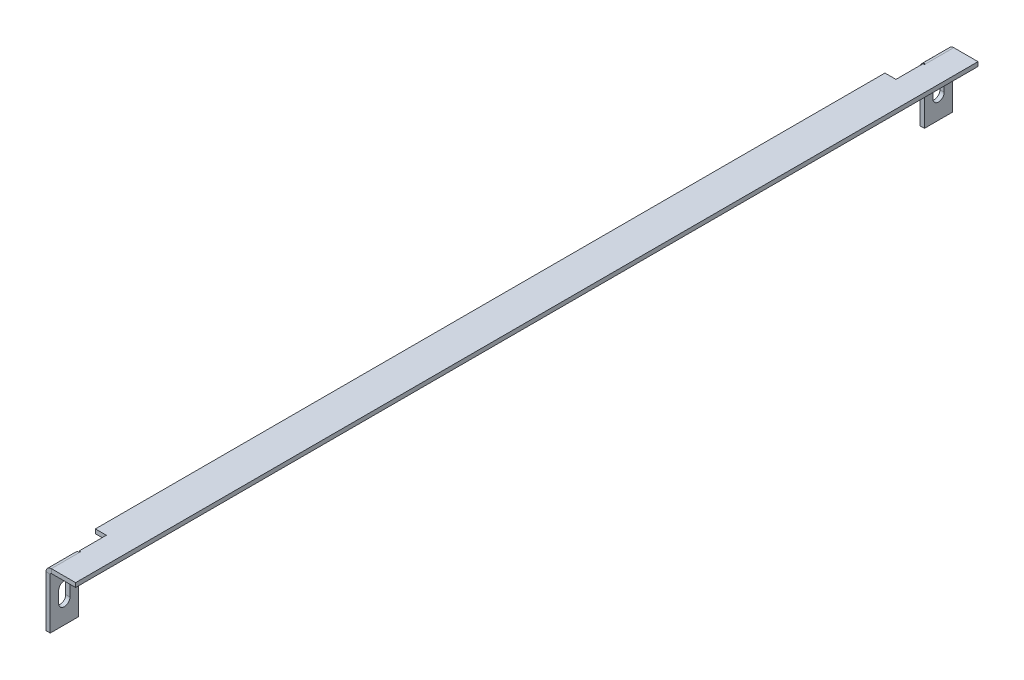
ISO-10303-21;
HEADER;
FILE_DESCRIPTION(('STEP AP214'),'2;1');
FILE_NAME('part.step','',(''),(''),'','','');
FILE_SCHEMA(('AUTOMOTIVE_DESIGN { 1 0 10303 214 1 1 1 1 }'));
ENDSEC;
DATA;
#1=APPLICATION_CONTEXT('core data for automotive mechanical design processes');
#2=APPLICATION_PROTOCOL_DEFINITION('international standard','automotive_design',2000,#1);
#3=PRODUCT_CONTEXT('',#1,'mechanical');
#4=PRODUCT('Part','Part','',(#3));
#5=PRODUCT_RELATED_PRODUCT_CATEGORY('part','',(#4));
#6=PRODUCT_DEFINITION_FORMATION('','',#4);
#7=PRODUCT_DEFINITION_CONTEXT('part definition',#1,'design');
#8=PRODUCT_DEFINITION('design','',#6,#7);
#9=PRODUCT_DEFINITION_SHAPE('','',#8);
#10=(LENGTH_UNIT() NAMED_UNIT(*) SI_UNIT(.MILLI.,.METRE.));
#11=(NAMED_UNIT(*) PLANE_ANGLE_UNIT() SI_UNIT($,.RADIAN.));
#12=(NAMED_UNIT(*) SI_UNIT($,.STERADIAN.) SOLID_ANGLE_UNIT());
#13=UNCERTAINTY_MEASURE_WITH_UNIT(LENGTH_MEASURE(1.E-05),#10,'distance_accuracy_value','');
#14=(GEOMETRIC_REPRESENTATION_CONTEXT(3) GLOBAL_UNCERTAINTY_ASSIGNED_CONTEXT((#13)) GLOBAL_UNIT_ASSIGNED_CONTEXT((#10,
#11,#12)) REPRESENTATION_CONTEXT('',''));
#15=CARTESIAN_POINT('',(0.,0.,0.));
#16=DIRECTION('',(0.,0.,1.));
#17=DIRECTION('',(1.,0.,0.));
#18=AXIS2_PLACEMENT_3D('',#15,#16,#17);
#19=CARTESIAN_POINT('',(29.999999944,-16.8000000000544,305.999999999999));
#20=DIRECTION('',(0.,0.,-1.));
#21=DIRECTION('',(-1.,0.,0.));
#22=AXIS2_PLACEMENT_3D('',#19,#20,#21);
#23=PLANE('',#22);
#24=DIRECTION('',(0.,1.,0.));
#25=VECTOR('',#24,1.);
#26=CARTESIAN_POINT('',(8.99999999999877,-80.1123422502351,305.999999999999));
#27=LINE('',#26,#25);
#28=CARTESIAN_POINT('',(8.99999999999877,-16.8000000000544,305.999999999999));
#29=VERTEX_POINT('',#28);
#30=CARTESIAN_POINT('',(8.99999999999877,-24.8000000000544,305.999999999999));
#31=VERTEX_POINT('',#30);
#32=EDGE_CURVE('E292',#29,#31,#27,.F.);
#33=ORIENTED_EDGE('',*,*,#32,.T.);
#34=DIRECTION('',(-1.,0.,0.));
#35=VECTOR('',#34,1.);
#36=CARTESIAN_POINT('',(29.999999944,-24.8000000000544,305.999999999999));
#37=LINE('',#36,#35);
#38=CARTESIAN_POINT('',(11.9999999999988,-24.8000000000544,305.999999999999));
#39=VERTEX_POINT('',#38);
#40=EDGE_CURVE('E511',#39,#31,#37,.T.);
#41=ORIENTED_EDGE('',*,*,#40,.F.);
#42=DIRECTION('',(0.,1.,0.));
#43=VECTOR('',#42,1.);
#44=CARTESIAN_POINT('',(11.9999999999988,-80.1123422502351,305.999999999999));
#45=LINE('',#44,#43);
#46=CARTESIAN_POINT('',(11.9999999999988,-16.8000000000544,305.999999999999));
#47=VERTEX_POINT('',#46);
#48=EDGE_CURVE('E521',#39,#47,#45,.T.);
#49=ORIENTED_EDGE('',*,*,#48,.T.);
#50=DIRECTION('',(-1.,0.,0.));
#51=VECTOR('',#50,1.);
#52=CARTESIAN_POINT('',(29.999999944,-16.8000000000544,305.999999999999));
#53=LINE('',#52,#51);
#54=EDGE_CURVE('E500',#29,#47,#53,.F.);
#55=ORIENTED_EDGE('',*,*,#54,.F.);
#56=EDGE_LOOP('',(#33,#41,#49,#55));
#57=FACE_BOUND('',#56,.T.);
#58=ADVANCED_FACE('F37',(#57),#23,.F.);
#59=CARTESIAN_POINT('',(29.999999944,-24.8000000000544,309.999999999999));
#60=DIRECTION('',(-1.,0.,0.));
#61=DIRECTION('',(0.,0.,1.));
#62=AXIS2_PLACEMENT_3D('',#59,#60,#61);
#63=CYLINDRICAL_SURFACE('',#62,4.);
#64=CARTESIAN_POINT('',(8.99999999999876,-24.8000000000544,309.999999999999));
#65=DIRECTION('',(-1.,0.,0.));
#66=DIRECTION('',(0.,0.,1.));
#67=AXIS2_PLACEMENT_3D('',#64,#65,#66);
#68=CIRCLE('',#67,4.);
#69=CARTESIAN_POINT('',(8.99999999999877,-24.8000000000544,313.999999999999));
#70=VERTEX_POINT('',#69);
#71=EDGE_CURVE('E518',#31,#70,#68,.T.);
#72=ORIENTED_EDGE('',*,*,#71,.T.);
#73=DIRECTION('',(1.,0.,0.));
#74=VECTOR('',#73,1.);
#75=CARTESIAN_POINT('',(29.999999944,-24.8000000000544,313.999999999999));
#76=LINE('',#75,#74);
#77=CARTESIAN_POINT('',(11.9999999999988,-24.8000000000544,313.999999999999));
#78=VERTEX_POINT('',#77);
#79=EDGE_CURVE('E515',#70,#78,#76,.T.);
#80=ORIENTED_EDGE('',*,*,#79,.T.);
#81=CARTESIAN_POINT('',(11.9999999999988,-24.8000000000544,309.999999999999));
#82=DIRECTION('',(-1.,0.,0.));
#83=DIRECTION('',(0.,0.,1.));
#84=AXIS2_PLACEMENT_3D('',#81,#82,#83);
#85=CIRCLE('',#84,4.);
#86=EDGE_CURVE('E56',#78,#39,#85,.F.);
#87=ORIENTED_EDGE('',*,*,#86,.T.);
#88=ORIENTED_EDGE('',*,*,#40,.T.);
#89=EDGE_LOOP('',(#72,#80,#87,#88));
#90=FACE_BOUND('',#89,.T.);
#91=ADVANCED_FACE('F598',(#90),#63,.F.);
#92=CARTESIAN_POINT('',(29.999999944,-16.8000000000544,313.999999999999));
#93=DIRECTION('',(0.,0.,1.));
#94=DIRECTION('',(1.,0.,0.));
#95=AXIS2_PLACEMENT_3D('',#92,#93,#94);
#96=PLANE('',#95);
#97=DIRECTION('',(0.,1.,0.));
#98=VECTOR('',#97,1.);
#99=CARTESIAN_POINT('',(8.99999999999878,-80.1123422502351,313.999999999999));
#100=LINE('',#99,#98);
#101=CARTESIAN_POINT('',(8.99999999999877,-16.8000000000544,313.999999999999));
#102=VERTEX_POINT('',#101);
#103=EDGE_CURVE('E508',#70,#102,#100,.T.);
#104=ORIENTED_EDGE('',*,*,#103,.T.);
#105=DIRECTION('',(-1.,0.,0.));
#106=VECTOR('',#105,1.);
#107=CARTESIAN_POINT('',(29.999999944,-16.8000000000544,313.999999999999));
#108=LINE('',#107,#106);
#109=CARTESIAN_POINT('',(11.9999999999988,-16.8000000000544,313.999999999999));
#110=VERTEX_POINT('',#109);
#111=EDGE_CURVE('E505',#102,#110,#108,.F.);
#112=ORIENTED_EDGE('',*,*,#111,.T.);
#113=DIRECTION('',(0.,1.,0.));
#114=VECTOR('',#113,1.);
#115=CARTESIAN_POINT('',(11.9999999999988,-80.1123422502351,313.999999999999));
#116=LINE('',#115,#114);
#117=EDGE_CURVE('E503',#110,#78,#116,.F.);
#118=ORIENTED_EDGE('',*,*,#117,.T.);
#119=ORIENTED_EDGE('',*,*,#79,.F.);
#120=EDGE_LOOP('',(#104,#112,#118,#119));
#121=FACE_BOUND('',#120,.T.);
#122=ADVANCED_FACE('F604',(#121),#96,.F.);
#123=CARTESIAN_POINT('',(29.999999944,-16.8000000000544,309.999999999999));
#124=DIRECTION('',(-1.,0.,0.));
#125=DIRECTION('',(0.,0.,1.));
#126=AXIS2_PLACEMENT_3D('',#123,#124,#125);
#127=CYLINDRICAL_SURFACE('',#126,4.);
#128=CARTESIAN_POINT('',(8.99999999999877,-16.8000000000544,309.999999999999));
#129=DIRECTION('',(-1.,0.,0.));
#130=DIRECTION('',(0.,0.,1.));
#131=AXIS2_PLACEMENT_3D('',#128,#129,#130);
#132=CIRCLE('',#131,4.);
#133=EDGE_CURVE('E103',#102,#29,#132,.T.);
#134=ORIENTED_EDGE('',*,*,#133,.T.);
#135=ORIENTED_EDGE('',*,*,#54,.T.);
#136=CARTESIAN_POINT('',(11.9999999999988,-16.8000000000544,309.999999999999));
#137=DIRECTION('',(-1.,0.,0.));
#138=DIRECTION('',(0.,0.,1.));
#139=AXIS2_PLACEMENT_3D('',#136,#137,#138);
#140=CIRCLE('',#139,4.);
#141=EDGE_CURVE('E100',#47,#110,#140,.F.);
#142=ORIENTED_EDGE('',*,*,#141,.T.);
#143=ORIENTED_EDGE('',*,*,#111,.F.);
#144=EDGE_LOOP('',(#134,#135,#142,#143));
#145=FACE_BOUND('',#144,.T.);
#146=ADVANCED_FACE('F612',(#145),#127,.F.);
#147=CARTESIAN_POINT('',(91.7149321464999,-40.,320.));
#148=DIRECTION('',(0.,-1.,0.));
#149=DIRECTION('',(1.,0.,0.));
#150=AXIS2_PLACEMENT_3D('',#147,#148,#149);
#151=PLANE('',#150);
#152=DIRECTION('',(0.,0.,-1.));
#153=VECTOR('',#152,1.);
#154=CARTESIAN_POINT('',(8.99999999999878,-40.,320.));
#155=LINE('',#154,#153);
#156=CARTESIAN_POINT('',(8.99999999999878,-40.,320.));
#157=VERTEX_POINT('',#156);
#158=CARTESIAN_POINT('',(8.99999999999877,-40.,299.999999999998));
#159=VERTEX_POINT('',#158);
#160=EDGE_CURVE('E268',#157,#159,#155,.T.);
#161=ORIENTED_EDGE('',*,*,#160,.T.);
#162=DIRECTION('',(-1.,0.,0.));
#163=VECTOR('',#162,1.);
#164=CARTESIAN_POINT('',(91.7149321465,-40.,299.999999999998));
#165=LINE('',#164,#163);
#166=CARTESIAN_POINT('',(11.9999999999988,-40.,299.999999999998));
#167=VERTEX_POINT('',#166);
#168=EDGE_CURVE('E47',#167,#159,#165,.T.);
#169=ORIENTED_EDGE('',*,*,#168,.F.);
#170=DIRECTION('',(0.,0.,1.));
#171=VECTOR('',#170,1.);
#172=CARTESIAN_POINT('',(11.9999999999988,-40.,320.));
#173=LINE('',#172,#171);
#174=CARTESIAN_POINT('',(11.9999999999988,-40.,320.));
#175=VERTEX_POINT('',#174);
#176=EDGE_CURVE('E496',#167,#175,#173,.T.);
#177=ORIENTED_EDGE('',*,*,#176,.T.);
#178=DIRECTION('',(-1.,0.,0.));
#179=VECTOR('',#178,1.);
#180=CARTESIAN_POINT('',(91.7149321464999,-40.,320.));
#181=LINE('',#180,#179);
#182=EDGE_CURVE('E272',#175,#157,#181,.T.);
#183=ORIENTED_EDGE('',*,*,#182,.T.);
#184=EDGE_LOOP('',(#161,#169,#177,#183));
#185=FACE_BOUND('',#184,.T.);
#186=ADVANCED_FACE('F616',(#185),#151,.T.);
#187=CARTESIAN_POINT('',(91.7149321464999,-2.1,320.));
#188=DIRECTION('',(0.,0.,1.));
#189=DIRECTION('',(1.,0.,0.));
#190=AXIS2_PLACEMENT_3D('',#187,#188,#189);
#191=PLANE('',#190);
#192=DIRECTION('',(0.,1.,0.));
#193=VECTOR('',#192,1.);
#194=CARTESIAN_POINT('',(8.99999999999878,-2.1,320.));
#195=LINE('',#194,#193);
#196=CARTESIAN_POINT('',(8.99999999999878,-3.79999999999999,320.));
#197=VERTEX_POINT('',#196);
#198=EDGE_CURVE('E260',#197,#157,#195,.F.);
#199=ORIENTED_EDGE('',*,*,#198,.T.);
#200=ORIENTED_EDGE('',*,*,#182,.F.);
#201=DIRECTION('',(0.,1.,0.));
#202=VECTOR('',#201,1.);
#203=CARTESIAN_POINT('',(11.9999999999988,-2.1,320.));
#204=LINE('',#203,#202);
#205=CARTESIAN_POINT('',(11.9999999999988,-3.79999999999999,320.));
#206=VERTEX_POINT('',#205);
#207=EDGE_CURVE('E271',#175,#206,#204,.T.);
#208=ORIENTED_EDGE('',*,*,#207,.T.);
#209=DIRECTION('',(-1.,0.,0.));
#210=VECTOR('',#209,1.);
#211=CARTESIAN_POINT('',(91.7149321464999,-3.79999999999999,320.));
#212=LINE('',#211,#210);
#213=EDGE_CURVE('E275',#206,#197,#212,.T.);
#214=ORIENTED_EDGE('',*,*,#213,.T.);
#215=EDGE_LOOP('',(#199,#200,#208,#214));
#216=FACE_BOUND('',#215,.T.);
#217=ADVANCED_FACE('F276',(#216),#191,.T.);
#218=CARTESIAN_POINT('',(8.99999999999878,-80.1123422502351,320.));
#219=DIRECTION('',(1.,0.,0.));
#220=DIRECTION('',(0.,0.,-1.));
#221=AXIS2_PLACEMENT_3D('',#218,#219,#220);
#222=PLANE('',#221);
#223=ORIENTED_EDGE('',*,*,#198,.F.);
#224=DIRECTION('',(0.,0.,1.));
#225=VECTOR('',#224,1.);
#226=CARTESIAN_POINT('',(8.99999999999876,-3.8,299.999999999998));
#227=LINE('',#226,#225);
#228=CARTESIAN_POINT('',(8.99999999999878,-3.8,299.999999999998));
#229=VERTEX_POINT('',#228);
#230=EDGE_CURVE('E266',#229,#197,#227,.T.);
#231=ORIENTED_EDGE('',*,*,#230,.F.);
#232=DIRECTION('',(0.,1.,0.));
#233=VECTOR('',#232,1.);
#234=CARTESIAN_POINT('',(8.99999999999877,-3.00000000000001,299.999999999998));
#235=LINE('',#234,#233);
#236=EDGE_CURVE('E282',#229,#159,#235,.F.);
#237=ORIENTED_EDGE('',*,*,#236,.T.);
#238=ORIENTED_EDGE('',*,*,#160,.F.);
#239=EDGE_LOOP('',(#223,#231,#237,#238));
#240=FACE_BOUND('',#239,.T.);
#241=ORIENTED_EDGE('',*,*,#133,.F.);
#242=ORIENTED_EDGE('',*,*,#103,.F.);
#243=ORIENTED_EDGE('',*,*,#71,.F.);
#244=ORIENTED_EDGE('',*,*,#32,.F.);
#245=EDGE_LOOP('',(#241,#242,#243,#244));
#246=FACE_BOUND('',#245,.T.);
#247=ADVANCED_FACE('F262',(#240,#246),#222,.F.);
#248=CARTESIAN_POINT('',(91.7149321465,-3.00000000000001,299.999999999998));
#249=DIRECTION('',(0.,0.,1.));
#250=DIRECTION('',(1.,0.,0.));
#251=AXIS2_PLACEMENT_3D('',#248,#249,#250);
#252=PLANE('',#251);
#253=ORIENTED_EDGE('',*,*,#168,.T.);
#254=ORIENTED_EDGE('',*,*,#236,.F.);
#255=DIRECTION('',(-1.,0.,0.));
#256=VECTOR('',#255,1.);
#257=CARTESIAN_POINT('',(91.7149321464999,-3.8,299.999999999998));
#258=LINE('',#257,#256);
#259=CARTESIAN_POINT('',(11.9999999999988,-3.8,299.999999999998));
#260=VERTEX_POINT('',#259);
#261=EDGE_CURVE('E293',#260,#229,#258,.T.);
#262=ORIENTED_EDGE('',*,*,#261,.F.);
#263=DIRECTION('',(0.,1.,0.));
#264=VECTOR('',#263,1.);
#265=CARTESIAN_POINT('',(11.9999999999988,-3.00000000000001,299.999999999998));
#266=LINE('',#265,#264);
#267=EDGE_CURVE('E11',#167,#260,#266,.T.);
#268=ORIENTED_EDGE('',*,*,#267,.F.);
#269=EDGE_LOOP('',(#253,#254,#262,#268));
#270=FACE_BOUND('',#269,.T.);
#271=ADVANCED_FACE('F623',(#270),#252,.F.);
#272=CARTESIAN_POINT('',(11.9999999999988,-80.1123422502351,320.));
#273=DIRECTION('',(-1.,0.,0.));
#274=DIRECTION('',(0.,0.,1.));
#275=AXIS2_PLACEMENT_3D('',#272,#273,#274);
#276=PLANE('',#275);
#277=ORIENTED_EDGE('',*,*,#267,.T.);
#278=DIRECTION('',(0.,0.,1.));
#279=VECTOR('',#278,1.);
#280=CARTESIAN_POINT('',(11.9999999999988,-3.79999999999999,320.));
#281=LINE('',#280,#279);
#282=EDGE_CURVE('E41',#206,#260,#281,.F.);
#283=ORIENTED_EDGE('',*,*,#282,.F.);
#284=ORIENTED_EDGE('',*,*,#207,.F.);
#285=ORIENTED_EDGE('',*,*,#176,.F.);
#286=EDGE_LOOP('',(#277,#283,#284,#285));
#287=FACE_BOUND('',#286,.T.);
#288=ORIENTED_EDGE('',*,*,#141,.F.);
#289=ORIENTED_EDGE('',*,*,#48,.F.);
#290=ORIENTED_EDGE('',*,*,#86,.F.);
#291=ORIENTED_EDGE('',*,*,#117,.F.);
#292=EDGE_LOOP('',(#288,#289,#290,#291));
#293=FACE_BOUND('',#292,.T.);
#294=ADVANCED_FACE('F39',(#287,#293),#276,.F.);
#295=CARTESIAN_POINT('',(29.999999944,-16.8000000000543,-313.999999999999));
#296=DIRECTION('',(0.,0.,-1.));
#297=DIRECTION('',(-1.,0.,0.));
#298=AXIS2_PLACEMENT_3D('',#295,#296,#297);
#299=PLANE('',#298);
#300=DIRECTION('',(-1.,0.,0.));
#301=VECTOR('',#300,1.);
#302=CARTESIAN_POINT('',(29.999999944,-16.8000000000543,-313.999999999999));
#303=LINE('',#302,#301);
#304=CARTESIAN_POINT('',(11.9999999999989,-16.8000000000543,-313.999999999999));
#305=VERTEX_POINT('',#304);
#306=CARTESIAN_POINT('',(8.99999999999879,-16.8000000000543,-313.999999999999));
#307=VERTEX_POINT('',#306);
#308=EDGE_CURVE('E485',#305,#307,#303,.T.);
#309=ORIENTED_EDGE('',*,*,#308,.T.);
#310=DIRECTION('',(0.,1.,0.));
#311=VECTOR('',#310,1.);
#312=CARTESIAN_POINT('',(8.99999999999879,-80.1123422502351,-313.999999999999));
#313=LINE('',#312,#311);
#314=CARTESIAN_POINT('',(8.99999999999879,-24.8000000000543,-313.999999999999));
#315=VERTEX_POINT('',#314);
#316=EDGE_CURVE('E482',#307,#315,#313,.F.);
#317=ORIENTED_EDGE('',*,*,#316,.T.);
#318=DIRECTION('',(-1.,0.,0.));
#319=VECTOR('',#318,1.);
#320=CARTESIAN_POINT('',(29.999999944,-24.8000000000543,-313.999999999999));
#321=LINE('',#320,#319);
#322=CARTESIAN_POINT('',(11.9999999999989,-24.8000000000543,-313.999999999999));
#323=VERTEX_POINT('',#322);
#324=EDGE_CURVE('E469',#323,#315,#321,.T.);
#325=ORIENTED_EDGE('',*,*,#324,.F.);
#326=DIRECTION('',(0.,1.,0.));
#327=VECTOR('',#326,1.);
#328=CARTESIAN_POINT('',(11.9999999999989,-80.1123422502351,-313.999999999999));
#329=LINE('',#328,#327);
#330=EDGE_CURVE('E479',#323,#305,#329,.T.);
#331=ORIENTED_EDGE('',*,*,#330,.T.);
#332=EDGE_LOOP('',(#309,#317,#325,#331));
#333=FACE_BOUND('',#332,.T.);
#334=ADVANCED_FACE('F629',(#333),#299,.F.);
#335=CARTESIAN_POINT('',(29.999999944,-24.8000000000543,-309.999999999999));
#336=DIRECTION('',(-1.,0.,0.));
#337=DIRECTION('',(0.,0.,1.));
#338=AXIS2_PLACEMENT_3D('',#335,#336,#337);
#339=CYLINDRICAL_SURFACE('',#338,4.);
#340=CARTESIAN_POINT('',(8.9999999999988,-24.8000000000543,-309.999999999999));
#341=DIRECTION('',(-1.,0.,0.));
#342=DIRECTION('',(0.,0.,1.));
#343=AXIS2_PLACEMENT_3D('',#340,#341,#342);
#344=CIRCLE('',#343,4.);
#345=CARTESIAN_POINT('',(8.99999999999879,-24.8000000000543,-305.999999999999));
#346=VERTEX_POINT('',#345);
#347=EDGE_CURVE('E476',#315,#346,#344,.T.);
#348=ORIENTED_EDGE('',*,*,#347,.T.);
#349=DIRECTION('',(1.,0.,0.));
#350=VECTOR('',#349,1.);
#351=CARTESIAN_POINT('',(29.999999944,-24.8000000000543,-305.999999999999));
#352=LINE('',#351,#350);
#353=CARTESIAN_POINT('',(11.9999999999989,-24.8000000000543,-305.999999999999));
#354=VERTEX_POINT('',#353);
#355=EDGE_CURVE('E473',#346,#354,#352,.T.);
#356=ORIENTED_EDGE('',*,*,#355,.T.);
#357=CARTESIAN_POINT('',(11.9999999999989,-24.8000000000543,-309.999999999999));
#358=DIRECTION('',(-1.,0.,0.));
#359=DIRECTION('',(0.,0.,1.));
#360=AXIS2_PLACEMENT_3D('',#357,#358,#359);
#361=CIRCLE('',#360,4.);
#362=EDGE_CURVE('E112',#354,#323,#361,.F.);
#363=ORIENTED_EDGE('',*,*,#362,.T.);
#364=ORIENTED_EDGE('',*,*,#324,.T.);
#365=EDGE_LOOP('',(#348,#356,#363,#364));
#366=FACE_BOUND('',#365,.T.);
#367=ADVANCED_FACE('F638',(#366),#339,.F.);
#368=CARTESIAN_POINT('',(29.999999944,-16.8000000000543,-305.999999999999));
#369=DIRECTION('',(0.,0.,1.));
#370=DIRECTION('',(1.,0.,0.));
#371=AXIS2_PLACEMENT_3D('',#368,#369,#370);
#372=PLANE('',#371);
#373=ORIENTED_EDGE('',*,*,#355,.F.);
#374=DIRECTION('',(0.,1.,0.));
#375=VECTOR('',#374,1.);
#376=CARTESIAN_POINT('',(8.99999999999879,-80.1123422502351,-305.999999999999));
#377=LINE('',#376,#375);
#378=CARTESIAN_POINT('',(8.99999999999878,-16.8000000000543,-305.999999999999));
#379=VERTEX_POINT('',#378);
#380=EDGE_CURVE('E466',#346,#379,#377,.T.);
#381=ORIENTED_EDGE('',*,*,#380,.T.);
#382=DIRECTION('',(1.,0.,0.));
#383=VECTOR('',#382,1.);
#384=CARTESIAN_POINT('',(29.999999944,-16.8000000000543,-305.999999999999));
#385=LINE('',#384,#383);
#386=CARTESIAN_POINT('',(11.9999999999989,-16.8000000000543,-305.999999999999));
#387=VERTEX_POINT('',#386);
#388=EDGE_CURVE('E460',#387,#379,#385,.F.);
#389=ORIENTED_EDGE('',*,*,#388,.F.);
#390=DIRECTION('',(0.,1.,0.));
#391=VECTOR('',#390,1.);
#392=CARTESIAN_POINT('',(11.9999999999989,-80.1123422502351,-305.999999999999));
#393=LINE('',#392,#391);
#394=EDGE_CURVE('E464',#387,#354,#393,.F.);
#395=ORIENTED_EDGE('',*,*,#394,.T.);
#396=EDGE_LOOP('',(#373,#381,#389,#395));
#397=FACE_BOUND('',#396,.T.);
#398=ADVANCED_FACE('F644',(#397),#372,.F.);
#399=CARTESIAN_POINT('',(29.999999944,-16.8000000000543,-309.999999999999));
#400=DIRECTION('',(-1.,0.,0.));
#401=DIRECTION('',(0.,0.,1.));
#402=AXIS2_PLACEMENT_3D('',#399,#400,#401);
#403=CYLINDRICAL_SURFACE('',#402,4.);
#404=CARTESIAN_POINT('',(8.99999999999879,-16.8000000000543,-309.999999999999));
#405=DIRECTION('',(-1.,0.,0.));
#406=DIRECTION('',(0.,0.,1.));
#407=AXIS2_PLACEMENT_3D('',#404,#405,#406);
#408=CIRCLE('',#407,4.);
#409=EDGE_CURVE('E152',#379,#307,#408,.T.);
#410=ORIENTED_EDGE('',*,*,#409,.T.);
#411=ORIENTED_EDGE('',*,*,#308,.F.);
#412=CARTESIAN_POINT('',(11.9999999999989,-16.8000000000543,-309.999999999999));
#413=DIRECTION('',(-1.,0.,0.));
#414=DIRECTION('',(0.,0.,1.));
#415=AXIS2_PLACEMENT_3D('',#412,#413,#414);
#416=CIRCLE('',#415,4.);
#417=EDGE_CURVE('E150',#305,#387,#416,.F.);
#418=ORIENTED_EDGE('',*,*,#417,.T.);
#419=ORIENTED_EDGE('',*,*,#388,.T.);
#420=EDGE_LOOP('',(#410,#411,#418,#419));
#421=FACE_BOUND('',#420,.T.);
#422=ADVANCED_FACE('F595',(#421),#403,.F.);
#423=CARTESIAN_POINT('',(91.7149321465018,-39.9999999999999,320.));
#424=DIRECTION('',(0.,-1.,0.));
#425=DIRECTION('',(0.,0.,1.));
#426=AXIS2_PLACEMENT_3D('',#423,#424,#425);
#427=PLANE('',#426);
#428=DIRECTION('',(0.,0.,-1.));
#429=VECTOR('',#428,1.);
#430=CARTESIAN_POINT('',(8.99999999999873,-39.9999999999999,320.));
#431=LINE('',#430,#429);
#432=CARTESIAN_POINT('',(8.99999999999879,-40.,-299.999999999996));
#433=VERTEX_POINT('',#432);
#434=CARTESIAN_POINT('',(8.99999999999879,-40.,-320.));
#435=VERTEX_POINT('',#434);
#436=EDGE_CURVE('E458',#433,#435,#431,.T.);
#437=ORIENTED_EDGE('',*,*,#436,.T.);
#438=DIRECTION('',(-1.,0.,0.));
#439=VECTOR('',#438,1.);
#440=CARTESIAN_POINT('',(91.7149321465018,-40.,-320.));
#441=LINE('',#440,#439);
#442=CARTESIAN_POINT('',(11.9999999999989,-40.,-320.));
#443=VERTEX_POINT('',#442);
#444=EDGE_CURVE('E434',#443,#435,#441,.T.);
#445=ORIENTED_EDGE('',*,*,#444,.F.);
#446=DIRECTION('',(0.,0.,-1.));
#447=VECTOR('',#446,1.);
#448=CARTESIAN_POINT('',(11.9999999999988,-39.9999999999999,320.));
#449=LINE('',#448,#447);
#450=CARTESIAN_POINT('',(11.9999999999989,-40.,-299.999999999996));
#451=VERTEX_POINT('',#450);
#452=EDGE_CURVE('E456',#443,#451,#449,.F.);
#453=ORIENTED_EDGE('',*,*,#452,.T.);
#454=DIRECTION('',(-1.,0.,0.));
#455=VECTOR('',#454,1.);
#456=CARTESIAN_POINT('',(91.7149321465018,-40.,-299.999999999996));
#457=LINE('',#456,#455);
#458=EDGE_CURVE('E453',#451,#433,#457,.T.);
#459=ORIENTED_EDGE('',*,*,#458,.T.);
#460=EDGE_LOOP('',(#437,#445,#453,#459));
#461=FACE_BOUND('',#460,.T.);
#462=ADVANCED_FACE('F579',(#461),#427,.T.);
#463=CARTESIAN_POINT('',(91.7149321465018,-80.1123422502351,-299.999999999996));
#464=DIRECTION('',(0.,0.,1.));
#465=DIRECTION('',(0.,1.,0.));
#466=AXIS2_PLACEMENT_3D('',#463,#464,#465);
#467=PLANE('',#466);
#468=DIRECTION('',(0.,1.,0.));
#469=VECTOR('',#468,1.);
#470=CARTESIAN_POINT('',(8.99999999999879,-80.1123422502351,-299.999999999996));
#471=LINE('',#470,#469);
#472=CARTESIAN_POINT('',(8.99999999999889,-3.8,-299.999999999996));
#473=VERTEX_POINT('',#472);
#474=EDGE_CURVE('E451',#473,#433,#471,.F.);
#475=ORIENTED_EDGE('',*,*,#474,.T.);
#476=ORIENTED_EDGE('',*,*,#458,.F.);
#477=DIRECTION('',(0.,1.,0.));
#478=VECTOR('',#477,1.);
#479=CARTESIAN_POINT('',(11.9999999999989,-80.1123422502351,-299.999999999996));
#480=LINE('',#479,#478);
#481=CARTESIAN_POINT('',(11.9999999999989,-3.8,-299.999999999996));
#482=VERTEX_POINT('',#481);
#483=EDGE_CURVE('E448',#451,#482,#480,.T.);
#484=ORIENTED_EDGE('',*,*,#483,.T.);
#485=DIRECTION('',(-1.,0.,0.));
#486=VECTOR('',#485,1.);
#487=CARTESIAN_POINT('',(91.7149321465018,-3.8,-299.999999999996));
#488=LINE('',#487,#486);
#489=EDGE_CURVE('E445',#482,#473,#488,.T.);
#490=ORIENTED_EDGE('',*,*,#489,.T.);
#491=EDGE_LOOP('',(#475,#476,#484,#490));
#492=FACE_BOUND('',#491,.T.);
#493=ADVANCED_FACE('F586',(#492),#467,.T.);
#494=CARTESIAN_POINT('',(8.99999999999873,-80.1123422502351,320.));
#495=DIRECTION('',(1.,0.,0.));
#496=DIRECTION('',(0.,0.,-1.));
#497=AXIS2_PLACEMENT_3D('',#494,#495,#496);
#498=PLANE('',#497);
#499=ORIENTED_EDGE('',*,*,#409,.F.);
#500=ORIENTED_EDGE('',*,*,#380,.F.);
#501=ORIENTED_EDGE('',*,*,#347,.F.);
#502=ORIENTED_EDGE('',*,*,#316,.F.);
#503=EDGE_LOOP('',(#499,#500,#501,#502));
#504=FACE_BOUND('',#503,.T.);
#505=DIRECTION('',(0.,0.,-1.));
#506=VECTOR('',#505,1.);
#507=CARTESIAN_POINT('',(8.99999999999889,-3.8,-299.999999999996));
#508=LINE('',#507,#506);
#509=CARTESIAN_POINT('',(8.99999999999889,-3.8,-320.));
#510=VERTEX_POINT('',#509);
#511=EDGE_CURVE('E442',#473,#510,#508,.T.);
#512=ORIENTED_EDGE('',*,*,#511,.T.);
#513=DIRECTION('',(0.,1.,0.));
#514=VECTOR('',#513,1.);
#515=CARTESIAN_POINT('',(8.99999999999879,-2.00000000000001,-320.));
#516=LINE('',#515,#514);
#517=EDGE_CURVE('E439',#435,#510,#516,.T.);
#518=ORIENTED_EDGE('',*,*,#517,.F.);
#519=ORIENTED_EDGE('',*,*,#436,.F.);
#520=ORIENTED_EDGE('',*,*,#474,.F.);
#521=EDGE_LOOP('',(#512,#518,#519,#520));
#522=FACE_BOUND('',#521,.T.);
#523=ADVANCED_FACE('F573',(#504,#522),#498,.F.);
#524=CARTESIAN_POINT('',(91.7149321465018,-2.,-320.));
#525=DIRECTION('',(0.,0.,-1.));
#526=DIRECTION('',(0.,-1.,0.));
#527=AXIS2_PLACEMENT_3D('',#524,#525,#526);
#528=PLANE('',#527);
#529=ORIENTED_EDGE('',*,*,#517,.T.);
#530=DIRECTION('',(-1.,0.,0.));
#531=VECTOR('',#530,1.);
#532=CARTESIAN_POINT('',(91.7149321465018,-3.8,-320.));
#533=LINE('',#532,#531);
#534=CARTESIAN_POINT('',(11.9999999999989,-3.8,-320.));
#535=VERTEX_POINT('',#534);
#536=EDGE_CURVE('E487',#535,#510,#533,.T.);
#537=ORIENTED_EDGE('',*,*,#536,.F.);
#538=DIRECTION('',(0.,1.,0.));
#539=VECTOR('',#538,1.);
#540=CARTESIAN_POINT('',(11.9999999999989,-2.,-320.));
#541=LINE('',#540,#539);
#542=EDGE_CURVE('E437',#535,#443,#541,.F.);
#543=ORIENTED_EDGE('',*,*,#542,.T.);
#544=ORIENTED_EDGE('',*,*,#444,.T.);
#545=EDGE_LOOP('',(#529,#537,#543,#544));
#546=FACE_BOUND('',#545,.T.);
#547=ADVANCED_FACE('F575',(#546),#528,.T.);
#548=CARTESIAN_POINT('',(11.9999999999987,-80.1123422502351,320.));
#549=DIRECTION('',(-1.,0.,0.));
#550=DIRECTION('',(0.,0.,1.));
#551=AXIS2_PLACEMENT_3D('',#548,#549,#550);
#552=PLANE('',#551);
#553=ORIENTED_EDGE('',*,*,#483,.F.);
#554=ORIENTED_EDGE('',*,*,#452,.F.);
#555=ORIENTED_EDGE('',*,*,#542,.F.);
#556=DIRECTION('',(0.,0.,1.));
#557=VECTOR('',#556,1.);
#558=CARTESIAN_POINT('',(11.9999999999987,-3.79999999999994,320.));
#559=LINE('',#558,#557);
#560=EDGE_CURVE('E433',#482,#535,#559,.F.);
#561=ORIENTED_EDGE('',*,*,#560,.F.);
#562=EDGE_LOOP('',(#553,#554,#555,#561));
#563=FACE_BOUND('',#562,.T.);
#564=ORIENTED_EDGE('',*,*,#417,.F.);
#565=ORIENTED_EDGE('',*,*,#330,.F.);
#566=ORIENTED_EDGE('',*,*,#362,.F.);
#567=ORIENTED_EDGE('',*,*,#394,.F.);
#568=EDGE_LOOP('',(#564,#565,#566,#567));
#569=FACE_BOUND('',#568,.T.);
#570=ADVANCED_FACE('F583',(#563,#569),#552,.F.);
#571=CARTESIAN_POINT('',(0.,0.,320.));
#572=DIRECTION('',(0.,-1.,0.));
#573=DIRECTION('',(0.,0.,-1.));
#574=AXIS2_PLACEMENT_3D('',#571,#572,#573);
#575=PLANE('',#574);
#576=DIRECTION('',(0.,0.,-1.));
#577=VECTOR('',#576,1.);
#578=CARTESIAN_POINT('',(12.7999999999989,0.,-299.999999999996));
#579=LINE('',#578,#577);
#580=CARTESIAN_POINT('',(12.7999999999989,0.,-299.999999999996));
#581=VERTEX_POINT('',#580);
#582=CARTESIAN_POINT('',(12.7999999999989,0.,-320.));
#583=VERTEX_POINT('',#582);
#584=EDGE_CURVE('E312',#581,#583,#579,.T.);
#585=ORIENTED_EDGE('',*,*,#584,.F.);
#586=DIRECTION('',(0.,0.,-1.));
#587=VECTOR('',#586,1.);
#588=CARTESIAN_POINT('',(12.7999999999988,0.,-299.999999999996));
#589=LINE('',#588,#587);
#590=CARTESIAN_POINT('',(12.7999999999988,0.,-299.199999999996));
#591=VERTEX_POINT('',#590);
#592=EDGE_CURVE('E160',#591,#581,#589,.T.);
#593=ORIENTED_EDGE('',*,*,#592,.F.);
#594=DIRECTION('',(1.,0.,0.));
#595=VECTOR('',#594,1.);
#596=CARTESIAN_POINT('',(11.7999999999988,0.,-299.199999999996));
#597=LINE('',#596,#595);
#598=CARTESIAN_POINT('',(11.7999999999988,0.,-299.199999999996));
#599=VERTEX_POINT('',#598);
#600=EDGE_CURVE('E318',#599,#591,#597,.T.);
#601=ORIENTED_EDGE('',*,*,#600,.F.);
#602=DIRECTION('',(0.,0.,-1.));
#603=VECTOR('',#602,1.);
#604=CARTESIAN_POINT('',(11.7999999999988,0.,320.));
#605=LINE('',#604,#603);
#606=CARTESIAN_POINT('',(11.7999999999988,0.,-279.999999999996));
#607=VERTEX_POINT('',#606);
#608=EDGE_CURVE('E320',#607,#599,#605,.T.);
#609=ORIENTED_EDGE('',*,*,#608,.F.);
#610=DIRECTION('',(1.,0.,0.));
#611=VECTOR('',#610,1.);
#612=CARTESIAN_POINT('',(0.,0.,-279.999999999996));
#613=LINE('',#612,#611);
#614=CARTESIAN_POINT('',(3.99999999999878,0.,-279.999999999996));
#615=VERTEX_POINT('',#614);
#616=EDGE_CURVE('E323',#615,#607,#613,.T.);
#617=ORIENTED_EDGE('',*,*,#616,.F.);
#618=DIRECTION('',(0.,0.,-1.));
#619=VECTOR('',#618,1.);
#620=CARTESIAN_POINT('',(3.99999999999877,0.,320.));
#621=LINE('',#620,#619);
#622=CARTESIAN_POINT('',(3.99999999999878,0.,279.999999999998));
#623=VERTEX_POINT('',#622);
#624=EDGE_CURVE('E326',#623,#615,#621,.T.);
#625=ORIENTED_EDGE('',*,*,#624,.F.);
#626=DIRECTION('',(1.,0.,0.));
#627=VECTOR('',#626,1.);
#628=CARTESIAN_POINT('',(0.,0.,279.999999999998));
#629=LINE('',#628,#627);
#630=CARTESIAN_POINT('',(11.7999999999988,0.,279.999999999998));
#631=VERTEX_POINT('',#630);
#632=EDGE_CURVE('E329',#631,#623,#629,.F.);
#633=ORIENTED_EDGE('',*,*,#632,.F.);
#634=DIRECTION('',(0.,0.,-1.));
#635=VECTOR('',#634,1.);
#636=CARTESIAN_POINT('',(11.7999999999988,0.,320.));
#637=LINE('',#636,#635);
#638=CARTESIAN_POINT('',(11.7999999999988,0.,299.199999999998));
#639=VERTEX_POINT('',#638);
#640=EDGE_CURVE('E332',#639,#631,#637,.T.);
#641=ORIENTED_EDGE('',*,*,#640,.F.);
#642=DIRECTION('',(-1.,0.,0.));
#643=VECTOR('',#642,1.);
#644=CARTESIAN_POINT('',(11.7999999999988,0.,299.199999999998));
#645=LINE('',#644,#643);
#646=CARTESIAN_POINT('',(12.7999999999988,0.,299.199999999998));
#647=VERTEX_POINT('',#646);
#648=EDGE_CURVE('E335',#647,#639,#645,.T.);
#649=ORIENTED_EDGE('',*,*,#648,.F.);
#650=DIRECTION('',(0.,0.,-1.));
#651=VECTOR('',#650,1.);
#652=CARTESIAN_POINT('',(12.7999999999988,0.,299.999999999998));
#653=LINE('',#652,#651);
#654=CARTESIAN_POINT('',(12.7999999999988,0.,299.999999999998));
#655=VERTEX_POINT('',#654);
#656=EDGE_CURVE('E338',#655,#647,#653,.T.);
#657=ORIENTED_EDGE('',*,*,#656,.F.);
#658=DIRECTION('',(0.,0.,1.));
#659=VECTOR('',#658,1.);
#660=CARTESIAN_POINT('',(12.7999999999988,0.,299.999999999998));
#661=LINE('',#660,#659);
#662=CARTESIAN_POINT('',(12.7999999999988,0.,320.));
#663=VERTEX_POINT('',#662);
#664=EDGE_CURVE('E341',#655,#663,#661,.T.);
#665=ORIENTED_EDGE('',*,*,#664,.T.);
#666=DIRECTION('',(1.,0.,0.));
#667=VECTOR('',#666,1.);
#668=CARTESIAN_POINT('',(0.,0.,320.));
#669=LINE('',#668,#667);
#670=CARTESIAN_POINT('',(29.999999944,0.,320.));
#671=VERTEX_POINT('',#670);
#672=EDGE_CURVE('E343',#671,#663,#669,.F.);
#673=ORIENTED_EDGE('',*,*,#672,.F.);
#674=DIRECTION('',(0.,0.,-1.));
#675=VECTOR('',#674,1.);
#676=CARTESIAN_POINT('',(29.999999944,0.,320.));
#677=LINE('',#676,#675);
#678=CARTESIAN_POINT('',(29.999999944,0.,-320.));
#679=VERTEX_POINT('',#678);
#680=EDGE_CURVE('E346',#679,#671,#677,.F.);
#681=ORIENTED_EDGE('',*,*,#680,.F.);
#682=DIRECTION('',(1.,0.,0.));
#683=VECTOR('',#682,1.);
#684=CARTESIAN_POINT('',(0.,0.,-320.));
#685=LINE('',#684,#683);
#686=EDGE_CURVE('E349',#583,#679,#685,.T.);
#687=ORIENTED_EDGE('',*,*,#686,.F.);
#688=EDGE_LOOP('',(#585,#593,#601,#609,#617,#625,#633,#641,#649,#657,#665,#673,#681,#687));
#689=FACE_BOUND('',#688,.T.);
#690=ADVANCED_FACE('F545',(#689),#575,.F.);
#691=CARTESIAN_POINT('',(12.7999999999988,-1281.05581454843,-299.999999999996));
#692=DIRECTION('',(1.,0.,0.));
#693=DIRECTION('',(0.,0.,-1.));
#694=AXIS2_PLACEMENT_3D('',#691,#692,#693);
#695=PLANE('',#694);
#696=DIRECTION('',(0.,1.,0.));
#697=VECTOR('',#696,1.);
#698=CARTESIAN_POINT('',(12.7999999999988,-1281.05581454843,-299.199999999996));
#699=LINE('',#698,#697);
#700=CARTESIAN_POINT('',(12.7999999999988,-3.,-299.199999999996));
#701=VERTEX_POINT('',#700);
#702=EDGE_CURVE('E394',#701,#591,#699,.T.);
#703=ORIENTED_EDGE('',*,*,#702,.T.);
#704=ORIENTED_EDGE('',*,*,#592,.T.);
#705=DIRECTION('',(0.,1.,0.));
#706=VECTOR('',#705,1.);
#707=CARTESIAN_POINT('',(12.7999999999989,-1281.05581454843,-299.999999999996));
#708=LINE('',#707,#706);
#709=CARTESIAN_POINT('',(12.7999999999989,-3.,-299.999999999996));
#710=VERTEX_POINT('',#709);
#711=EDGE_CURVE('E431',#710,#581,#708,.T.);
#712=ORIENTED_EDGE('',*,*,#711,.F.);
#713=DIRECTION('',(0.,0.,-1.));
#714=VECTOR('',#713,1.);
#715=CARTESIAN_POINT('',(12.7999999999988,-3.,-299.999999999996));
#716=LINE('',#715,#714);
#717=EDGE_CURVE('E352',#701,#710,#716,.T.);
#718=ORIENTED_EDGE('',*,*,#717,.F.);
#719=EDGE_LOOP('',(#703,#704,#712,#718));
#720=FACE_BOUND('',#719,.T.);
#721=ADVANCED_FACE('F559',(#720),#695,.F.);
#722=CARTESIAN_POINT('',(2.1,-1281.05581454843,-320.));
#723=DIRECTION('',(0.,0.,-1.));
#724=DIRECTION('',(-1.,0.,0.));
#725=AXIS2_PLACEMENT_3D('',#722,#723,#724);
#726=PLANE('',#725);
#727=ORIENTED_EDGE('',*,*,#686,.T.);
#728=DIRECTION('',(0.,1.,0.));
#729=VECTOR('',#728,1.);
#730=CARTESIAN_POINT('',(29.999999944,-1281.05581454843,-320.));
#731=LINE('',#730,#729);
#732=CARTESIAN_POINT('',(29.999999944,-2.99999999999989,-320.));
#733=VERTEX_POINT('',#732);
#734=EDGE_CURVE('E425',#733,#679,#731,.T.);
#735=ORIENTED_EDGE('',*,*,#734,.F.);
#736=DIRECTION('',(-1.,0.,0.));
#737=VECTOR('',#736,1.);
#738=CARTESIAN_POINT('',(2.1,-3.,-320.));
#739=LINE('',#738,#737);
#740=CARTESIAN_POINT('',(12.7999999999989,-2.99999999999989,-320.));
#741=VERTEX_POINT('',#740);
#742=EDGE_CURVE('E358',#733,#741,#739,.T.);
#743=ORIENTED_EDGE('',*,*,#742,.T.);
#744=DIRECTION('',(0.,1.,0.));
#745=VECTOR('',#744,1.);
#746=CARTESIAN_POINT('',(12.7999999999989,-1281.05581454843,-320.));
#747=LINE('',#746,#745);
#748=EDGE_CURVE('E428',#741,#583,#747,.T.);
#749=ORIENTED_EDGE('',*,*,#748,.T.);
#750=EDGE_LOOP('',(#727,#735,#743,#749));
#751=FACE_BOUND('',#750,.T.);
#752=ADVANCED_FACE('F553',(#751),#726,.T.);
#753=CARTESIAN_POINT('',(29.999999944,-1281.05581454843,350.149626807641));
#754=DIRECTION('',(1.,0.,0.));
#755=DIRECTION('',(0.,0.,-1.));
#756=AXIS2_PLACEMENT_3D('',#753,#754,#755);
#757=PLANE('',#756);
#758=ORIENTED_EDGE('',*,*,#680,.T.);
#759=DIRECTION('',(0.,1.,0.));
#760=VECTOR('',#759,1.);
#761=CARTESIAN_POINT('',(29.999999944,-1281.05581454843,320.));
#762=LINE('',#761,#760);
#763=CARTESIAN_POINT('',(29.999999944,-2.99999999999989,320.));
#764=VERTEX_POINT('',#763);
#765=EDGE_CURVE('E422',#764,#671,#762,.T.);
#766=ORIENTED_EDGE('',*,*,#765,.F.);
#767=DIRECTION('',(0.,0.,-1.));
#768=VECTOR('',#767,1.);
#769=CARTESIAN_POINT('',(29.999999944,-3.,350.149626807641));
#770=LINE('',#769,#768);
#771=EDGE_CURVE('E361',#764,#733,#770,.T.);
#772=ORIENTED_EDGE('',*,*,#771,.T.);
#773=ORIENTED_EDGE('',*,*,#734,.T.);
#774=EDGE_LOOP('',(#758,#766,#772,#773));
#775=FACE_BOUND('',#774,.T.);
#776=ADVANCED_FACE('F549',(#775),#757,.T.);
#777=CARTESIAN_POINT('',(2.1,-1281.05581454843,320.));
#778=DIRECTION('',(0.,0.,1.));
#779=DIRECTION('',(1.,0.,0.));
#780=AXIS2_PLACEMENT_3D('',#777,#778,#779);
#781=PLANE('',#780);
#782=ORIENTED_EDGE('',*,*,#672,.T.);
#783=DIRECTION('',(0.,1.,0.));
#784=VECTOR('',#783,1.);
#785=CARTESIAN_POINT('',(12.7999999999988,-1281.05581454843,320.));
#786=LINE('',#785,#784);
#787=CARTESIAN_POINT('',(12.7999999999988,-2.99999999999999,320.));
#788=VERTEX_POINT('',#787);
#789=EDGE_CURVE('E297',#788,#663,#786,.T.);
#790=ORIENTED_EDGE('',*,*,#789,.F.);
#791=DIRECTION('',(1.,0.,0.));
#792=VECTOR('',#791,1.);
#793=CARTESIAN_POINT('',(2.1,-3.,320.));
#794=LINE('',#793,#792);
#795=EDGE_CURVE('E363',#788,#764,#794,.T.);
#796=ORIENTED_EDGE('',*,*,#795,.T.);
#797=ORIENTED_EDGE('',*,*,#765,.T.);
#798=EDGE_LOOP('',(#782,#790,#796,#797));
#799=FACE_BOUND('',#798,.T.);
#800=ADVANCED_FACE('F543',(#799),#781,.T.);
#801=CARTESIAN_POINT('',(12.7999999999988,-1281.05581454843,299.999999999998));
#802=DIRECTION('',(1.,0.,0.));
#803=DIRECTION('',(0.,0.,-1.));
#804=AXIS2_PLACEMENT_3D('',#801,#802,#803);
#805=PLANE('',#804);
#806=DIRECTION('',(0.,1.,0.));
#807=VECTOR('',#806,1.);
#808=CARTESIAN_POINT('',(12.7999999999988,-1281.05581454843,299.999999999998));
#809=LINE('',#808,#807);
#810=CARTESIAN_POINT('',(12.7999999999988,-2.99999999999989,299.999999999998));
#811=VERTEX_POINT('',#810);
#812=EDGE_CURVE('E418',#811,#655,#809,.T.);
#813=ORIENTED_EDGE('',*,*,#812,.T.);
#814=ORIENTED_EDGE('',*,*,#656,.T.);
#815=DIRECTION('',(0.,1.,0.));
#816=VECTOR('',#815,1.);
#817=CARTESIAN_POINT('',(12.7999999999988,-1281.05581454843,299.199999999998));
#818=LINE('',#817,#816);
#819=CARTESIAN_POINT('',(12.7999999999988,-2.99999999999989,299.199999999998));
#820=VERTEX_POINT('',#819);
#821=EDGE_CURVE('E415',#820,#647,#818,.T.);
#822=ORIENTED_EDGE('',*,*,#821,.F.);
#823=DIRECTION('',(0.,0.,-1.));
#824=VECTOR('',#823,1.);
#825=CARTESIAN_POINT('',(12.7999999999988,-3.,299.999999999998));
#826=LINE('',#825,#824);
#827=EDGE_CURVE('E368',#811,#820,#826,.T.);
#828=ORIENTED_EDGE('',*,*,#827,.F.);
#829=EDGE_LOOP('',(#813,#814,#822,#828));
#830=FACE_BOUND('',#829,.T.);
#831=ADVANCED_FACE('F537',(#830),#805,.F.);
#832=CARTESIAN_POINT('',(11.7999999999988,-1281.05581454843,299.199999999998));
#833=DIRECTION('',(0.,0.,-1.));
#834=DIRECTION('',(-1.,0.,0.));
#835=AXIS2_PLACEMENT_3D('',#832,#833,#834);
#836=PLANE('',#835);
#837=ORIENTED_EDGE('',*,*,#821,.T.);
#838=ORIENTED_EDGE('',*,*,#648,.T.);
#839=DIRECTION('',(0.,1.,0.));
#840=VECTOR('',#839,1.);
#841=CARTESIAN_POINT('',(11.7999999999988,-1281.05581454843,299.199999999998));
#842=LINE('',#841,#840);
#843=CARTESIAN_POINT('',(11.7999999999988,-2.99999999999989,299.199999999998));
#844=VERTEX_POINT('',#843);
#845=EDGE_CURVE('E412',#844,#639,#842,.T.);
#846=ORIENTED_EDGE('',*,*,#845,.F.);
#847=DIRECTION('',(-1.,0.,0.));
#848=VECTOR('',#847,1.);
#849=CARTESIAN_POINT('',(11.7999999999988,-3.,299.199999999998));
#850=LINE('',#849,#848);
#851=EDGE_CURVE('E371',#820,#844,#850,.T.);
#852=ORIENTED_EDGE('',*,*,#851,.F.);
#853=EDGE_LOOP('',(#837,#838,#846,#852));
#854=FACE_BOUND('',#853,.T.);
#855=ADVANCED_FACE('F734',(#854),#836,.F.);
#856=CARTESIAN_POINT('',(11.7999999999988,-1281.05581454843,299.999999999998));
#857=DIRECTION('',(1.,0.,0.));
#858=DIRECTION('',(0.,0.,-1.));
#859=AXIS2_PLACEMENT_3D('',#856,#857,#858);
#860=PLANE('',#859);
#861=ORIENTED_EDGE('',*,*,#845,.T.);
#862=ORIENTED_EDGE('',*,*,#640,.T.);
#863=DIRECTION('',(0.,1.,0.));
#864=VECTOR('',#863,1.);
#865=CARTESIAN_POINT('',(11.7999999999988,-1281.05581454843,279.999999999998));
#866=LINE('',#865,#864);
#867=CARTESIAN_POINT('',(11.7999999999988,-2.99999999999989,279.999999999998));
#868=VERTEX_POINT('',#867);
#869=EDGE_CURVE('E409',#868,#631,#866,.T.);
#870=ORIENTED_EDGE('',*,*,#869,.F.);
#871=DIRECTION('',(0.,0.,-1.));
#872=VECTOR('',#871,1.);
#873=CARTESIAN_POINT('',(11.7999999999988,-3.,299.999999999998));
#874=LINE('',#873,#872);
#875=EDGE_CURVE('E374',#844,#868,#874,.T.);
#876=ORIENTED_EDGE('',*,*,#875,.F.);
#877=EDGE_LOOP('',(#861,#862,#870,#876));
#878=FACE_BOUND('',#877,.T.);
#879=ADVANCED_FACE('F743',(#878),#860,.F.);
#880=CARTESIAN_POINT('',(11.7999999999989,-1281.05581454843,279.999999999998));
#881=DIRECTION('',(0.,0.,-1.));
#882=DIRECTION('',(-1.,0.,0.));
#883=AXIS2_PLACEMENT_3D('',#880,#881,#882);
#884=PLANE('',#883);
#885=ORIENTED_EDGE('',*,*,#869,.T.);
#886=ORIENTED_EDGE('',*,*,#632,.T.);
#887=DIRECTION('',(0.,1.,0.));
#888=VECTOR('',#887,1.);
#889=CARTESIAN_POINT('',(3.99999999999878,-1281.05581454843,279.999999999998));
#890=LINE('',#889,#888);
#891=CARTESIAN_POINT('',(3.99999999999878,-2.99999999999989,279.999999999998));
#892=VERTEX_POINT('',#891);
#893=EDGE_CURVE('E406',#892,#623,#890,.T.);
#894=ORIENTED_EDGE('',*,*,#893,.F.);
#895=DIRECTION('',(-1.,0.,0.));
#896=VECTOR('',#895,1.);
#897=CARTESIAN_POINT('',(11.7999999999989,-3.,279.999999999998));
#898=LINE('',#897,#896);
#899=EDGE_CURVE('E377',#868,#892,#898,.T.);
#900=ORIENTED_EDGE('',*,*,#899,.F.);
#901=EDGE_LOOP('',(#885,#886,#894,#900));
#902=FACE_BOUND('',#901,.T.);
#903=ADVANCED_FACE('F753',(#902),#884,.F.);
#904=CARTESIAN_POINT('',(3.99999999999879,-1281.05581454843,-320.));
#905=DIRECTION('',(1.,0.,0.));
#906=DIRECTION('',(0.,0.,-1.));
#907=AXIS2_PLACEMENT_3D('',#904,#905,#906);
#908=PLANE('',#907);
#909=ORIENTED_EDGE('',*,*,#893,.T.);
#910=ORIENTED_EDGE('',*,*,#624,.T.);
#911=DIRECTION('',(0.,1.,0.));
#912=VECTOR('',#911,1.);
#913=CARTESIAN_POINT('',(3.99999999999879,-1281.0558145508,-279.999999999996));
#914=LINE('',#913,#912);
#915=CARTESIAN_POINT('',(3.99999999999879,-2.99999999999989,-279.999999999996));
#916=VERTEX_POINT('',#915);
#917=EDGE_CURVE('E403',#916,#615,#914,.T.);
#918=ORIENTED_EDGE('',*,*,#917,.F.);
#919=DIRECTION('',(0.,0.,1.));
#920=VECTOR('',#919,1.);
#921=CARTESIAN_POINT('',(3.99999999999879,-3.,-320.));
#922=LINE('',#921,#920);
#923=EDGE_CURVE('E382',#892,#916,#922,.F.);
#924=ORIENTED_EDGE('',*,*,#923,.F.);
#925=EDGE_LOOP('',(#909,#910,#918,#924));
#926=FACE_BOUND('',#925,.T.);
#927=ADVANCED_FACE('F763',(#926),#908,.F.);
#928=CARTESIAN_POINT('',(11.7999999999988,-1281.05581455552,-279.999999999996));
#929=DIRECTION('',(0.,0.,1.));
#930=DIRECTION('',(1.,0.,0.));
#931=AXIS2_PLACEMENT_3D('',#928,#929,#930);
#932=PLANE('',#931);
#933=ORIENTED_EDGE('',*,*,#917,.T.);
#934=ORIENTED_EDGE('',*,*,#616,.T.);
#935=DIRECTION('',(0.,1.,0.));
#936=VECTOR('',#935,1.);
#937=CARTESIAN_POINT('',(11.7999999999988,-1281.0558145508,-279.999999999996));
#938=LINE('',#937,#936);
#939=CARTESIAN_POINT('',(11.7999999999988,-2.99999999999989,-279.999999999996));
#940=VERTEX_POINT('',#939);
#941=EDGE_CURVE('E400',#940,#607,#938,.T.);
#942=ORIENTED_EDGE('',*,*,#941,.F.);
#943=DIRECTION('',(1.,0.,0.));
#944=VECTOR('',#943,1.);
#945=CARTESIAN_POINT('',(11.7999999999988,-3.00000000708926,-279.999999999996));
#946=LINE('',#945,#944);
#947=EDGE_CURVE('E385',#916,#940,#946,.T.);
#948=ORIENTED_EDGE('',*,*,#947,.F.);
#949=EDGE_LOOP('',(#933,#934,#942,#948));
#950=FACE_BOUND('',#949,.T.);
#951=ADVANCED_FACE('F773',(#950),#932,.F.);
#952=CARTESIAN_POINT('',(11.7999999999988,-1281.05581454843,-299.999999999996));
#953=DIRECTION('',(1.,0.,0.));
#954=DIRECTION('',(0.,0.,-1.));
#955=AXIS2_PLACEMENT_3D('',#952,#953,#954);
#956=PLANE('',#955);
#957=ORIENTED_EDGE('',*,*,#941,.T.);
#958=ORIENTED_EDGE('',*,*,#608,.T.);
#959=DIRECTION('',(0.,1.,0.));
#960=VECTOR('',#959,1.);
#961=CARTESIAN_POINT('',(11.7999999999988,-1281.05581454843,-299.199999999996));
#962=LINE('',#961,#960);
#963=CARTESIAN_POINT('',(11.7999999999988,-2.99999999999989,-299.199999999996));
#964=VERTEX_POINT('',#963);
#965=EDGE_CURVE('E397',#964,#599,#962,.T.);
#966=ORIENTED_EDGE('',*,*,#965,.F.);
#967=DIRECTION('',(0.,0.,-1.));
#968=VECTOR('',#967,1.);
#969=CARTESIAN_POINT('',(11.7999999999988,-3.,-299.999999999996));
#970=LINE('',#969,#968);
#971=EDGE_CURVE('E388',#940,#964,#970,.T.);
#972=ORIENTED_EDGE('',*,*,#971,.F.);
#973=EDGE_LOOP('',(#957,#958,#966,#972));
#974=FACE_BOUND('',#973,.T.);
#975=ADVANCED_FACE('F783',(#974),#956,.F.);
#976=CARTESIAN_POINT('',(11.7999999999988,-1281.05581454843,-299.199999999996));
#977=DIRECTION('',(0.,0.,1.));
#978=DIRECTION('',(1.,0.,0.));
#979=AXIS2_PLACEMENT_3D('',#976,#977,#978);
#980=PLANE('',#979);
#981=ORIENTED_EDGE('',*,*,#965,.T.);
#982=ORIENTED_EDGE('',*,*,#600,.T.);
#983=ORIENTED_EDGE('',*,*,#702,.F.);
#984=DIRECTION('',(1.,0.,0.));
#985=VECTOR('',#984,1.);
#986=CARTESIAN_POINT('',(11.7999999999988,-3.,-299.199999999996));
#987=LINE('',#986,#985);
#988=EDGE_CURVE('E391',#964,#701,#987,.T.);
#989=ORIENTED_EDGE('',*,*,#988,.F.);
#990=EDGE_LOOP('',(#981,#982,#983,#989));
#991=FACE_BOUND('',#990,.T.);
#992=ADVANCED_FACE('F793',(#991),#980,.F.);
#993=CARTESIAN_POINT('',(29.999999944,-3.,350.149626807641));
#994=DIRECTION('',(0.,-1.,0.));
#995=DIRECTION('',(0.,0.,-1.));
#996=AXIS2_PLACEMENT_3D('',#993,#994,#995);
#997=PLANE('',#996);
#998=ORIENTED_EDGE('',*,*,#717,.T.);
#999=DIRECTION('',(0.,0.,-1.));
#1000=VECTOR('',#999,1.);
#1001=CARTESIAN_POINT('',(12.7999999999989,-3.,350.149626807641));
#1002=LINE('',#1001,#1000);
#1003=EDGE_CURVE('E355',#710,#741,#1002,.T.);
#1004=ORIENTED_EDGE('',*,*,#1003,.T.);
#1005=ORIENTED_EDGE('',*,*,#742,.F.);
#1006=ORIENTED_EDGE('',*,*,#771,.F.);
#1007=ORIENTED_EDGE('',*,*,#795,.F.);
#1008=DIRECTION('',(0.,0.,-1.));
#1009=VECTOR('',#1008,1.);
#1010=CARTESIAN_POINT('',(12.7999999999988,-3.,350.149626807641));
#1011=LINE('',#1010,#1009);
#1012=EDGE_CURVE('E365',#788,#811,#1011,.T.);
#1013=ORIENTED_EDGE('',*,*,#1012,.T.);
#1014=ORIENTED_EDGE('',*,*,#827,.T.);
#1015=ORIENTED_EDGE('',*,*,#851,.T.);
#1016=ORIENTED_EDGE('',*,*,#875,.T.);
#1017=ORIENTED_EDGE('',*,*,#899,.T.);
#1018=ORIENTED_EDGE('',*,*,#923,.T.);
#1019=ORIENTED_EDGE('',*,*,#947,.T.);
#1020=ORIENTED_EDGE('',*,*,#971,.T.);
#1021=ORIENTED_EDGE('',*,*,#988,.T.);
#1022=EDGE_LOOP('',(#998,#1004,#1005,#1006,#1007,#1013,#1014,#1015,#1016,#1017,#1018,#1019,
#1020,#1021));
#1023=FACE_BOUND('',#1022,.T.);
#1024=ADVANCED_FACE('F540',(#1023),#997,.T.);
#1025=CARTESIAN_POINT('',(12.7999999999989,-3.8,-320.));
#1026=DIRECTION('',(0.,0.,-1.));
#1027=DIRECTION('',(-1.,0.,0.));
#1028=AXIS2_PLACEMENT_3D('',#1025,#1026,#1027);
#1029=PLANE('',#1028);
#1030=ORIENTED_EDGE('',*,*,#748,.F.);
#1031=CARTESIAN_POINT('',(12.7999999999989,-3.8,-320.));
#1032=DIRECTION('',(0.,0.,-1.));
#1033=DIRECTION('',(-1.,0.,0.));
#1034=AXIS2_PLACEMENT_3D('',#1031,#1032,#1033);
#1035=CIRCLE('',#1034,0.8);
#1036=EDGE_CURVE('E168',#741,#535,#1035,.F.);
#1037=ORIENTED_EDGE('',*,*,#1036,.T.);
#1038=ORIENTED_EDGE('',*,*,#536,.T.);
#1039=CARTESIAN_POINT('',(12.7999999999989,-3.8,-320.));
#1040=DIRECTION('',(0.,0.,-1.));
#1041=DIRECTION('',(-1.,0.,0.));
#1042=AXIS2_PLACEMENT_3D('',#1039,#1040,#1041);
#1043=CIRCLE('',#1042,3.8);
#1044=EDGE_CURVE('E310',#583,#510,#1043,.F.);
#1045=ORIENTED_EDGE('',*,*,#1044,.F.);
#1046=EDGE_LOOP('',(#1030,#1037,#1038,#1045));
#1047=FACE_BOUND('',#1046,.T.);
#1048=ADVANCED_FACE('F566',(#1047),#1029,.T.);
#1049=CARTESIAN_POINT('',(12.7999999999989,-3.8,-299.999999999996));
#1050=DIRECTION('',(0.,0.,1.));
#1051=DIRECTION('',(1.,0.,0.));
#1052=AXIS2_PLACEMENT_3D('',#1049,#1050,#1051);
#1053=PLANE('',#1052);
#1054=ORIENTED_EDGE('',*,*,#489,.F.);
#1055=CARTESIAN_POINT('',(12.7999999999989,-3.8,-299.999999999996));
#1056=DIRECTION('',(0.,0.,-1.));
#1057=DIRECTION('',(-1.,0.,0.));
#1058=AXIS2_PLACEMENT_3D('',#1055,#1056,#1057);
#1059=CIRCLE('',#1058,0.8);
#1060=EDGE_CURVE('E300',#482,#710,#1059,.T.);
#1061=ORIENTED_EDGE('',*,*,#1060,.T.);
#1062=ORIENTED_EDGE('',*,*,#711,.T.);
#1063=CARTESIAN_POINT('',(12.7999999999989,-3.8,-299.999999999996));
#1064=DIRECTION('',(0.,0.,-1.));
#1065=DIRECTION('',(-1.,0.,0.));
#1066=AXIS2_PLACEMENT_3D('',#1063,#1064,#1065);
#1067=CIRCLE('',#1066,3.8);
#1068=EDGE_CURVE('E307',#473,#581,#1067,.T.);
#1069=ORIENTED_EDGE('',*,*,#1068,.F.);
#1070=EDGE_LOOP('',(#1054,#1061,#1062,#1069));
#1071=FACE_BOUND('',#1070,.T.);
#1072=ADVANCED_FACE('F562',(#1071),#1053,.T.);
#1073=CARTESIAN_POINT('',(12.7999999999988,-3.8,342.458469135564));
#1074=DIRECTION('',(0.,0.,-1.));
#1075=DIRECTION('',(-1.,0.,0.));
#1076=AXIS2_PLACEMENT_3D('',#1073,#1074,#1075);
#1077=CYLINDRICAL_SURFACE('',#1076,3.8);
#1078=ORIENTED_EDGE('',*,*,#1068,.T.);
#1079=ORIENTED_EDGE('',*,*,#584,.T.);
#1080=ORIENTED_EDGE('',*,*,#1044,.T.);
#1081=ORIENTED_EDGE('',*,*,#511,.F.);
#1082=EDGE_LOOP('',(#1078,#1079,#1080,#1081));
#1083=FACE_BOUND('',#1082,.T.);
#1084=ADVANCED_FACE('F564',(#1083),#1077,.T.);
#1085=CARTESIAN_POINT('',(12.7999999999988,-3.8,342.458469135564));
#1086=DIRECTION('',(0.,0.,-1.));
#1087=DIRECTION('',(-1.,0.,0.));
#1088=AXIS2_PLACEMENT_3D('',#1085,#1086,#1087);
#1089=CYLINDRICAL_SURFACE('',#1088,0.8);
#1090=ORIENTED_EDGE('',*,*,#1060,.F.);
#1091=ORIENTED_EDGE('',*,*,#560,.T.);
#1092=ORIENTED_EDGE('',*,*,#1036,.F.);
#1093=ORIENTED_EDGE('',*,*,#1003,.F.);
#1094=EDGE_LOOP('',(#1090,#1091,#1092,#1093));
#1095=FACE_BOUND('',#1094,.T.);
#1096=ADVANCED_FACE('F557',(#1095),#1089,.F.);
#1097=CARTESIAN_POINT('',(12.7999999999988,-3.8,299.999999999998));
#1098=DIRECTION('',(0.,0.,-1.));
#1099=DIRECTION('',(-1.,0.,0.));
#1100=AXIS2_PLACEMENT_3D('',#1097,#1098,#1099);
#1101=PLANE('',#1100);
#1102=ORIENTED_EDGE('',*,*,#812,.F.);
#1103=CARTESIAN_POINT('',(12.7999999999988,-3.8,299.999999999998));
#1104=DIRECTION('',(0.,0.,-1.));
#1105=DIRECTION('',(0.,1.,0.));
#1106=AXIS2_PLACEMENT_3D('',#1103,#1104,#1105);
#1107=CIRCLE('',#1106,0.800000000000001);
#1108=EDGE_CURVE('E298',#811,#260,#1107,.F.);
#1109=ORIENTED_EDGE('',*,*,#1108,.T.);
#1110=ORIENTED_EDGE('',*,*,#261,.T.);
#1111=CARTESIAN_POINT('',(12.7999999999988,-3.8,299.999999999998));
#1112=DIRECTION('',(0.,0.,-1.));
#1113=DIRECTION('',(0.,1.,0.));
#1114=AXIS2_PLACEMENT_3D('',#1111,#1112,#1113);
#1115=CIRCLE('',#1114,3.8);
#1116=EDGE_CURVE('E291',#655,#229,#1115,.F.);
#1117=ORIENTED_EDGE('',*,*,#1116,.F.);
#1118=EDGE_LOOP('',(#1102,#1109,#1110,#1117));
#1119=FACE_BOUND('',#1118,.T.);
#1120=ADVANCED_FACE('F533',(#1119),#1101,.T.);
#1121=CARTESIAN_POINT('',(12.7999999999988,-3.79999999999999,320.));
#1122=DIRECTION('',(0.,0.,1.));
#1123=DIRECTION('',(1.,0.,0.));
#1124=AXIS2_PLACEMENT_3D('',#1121,#1122,#1123);
#1125=PLANE('',#1124);
#1126=ORIENTED_EDGE('',*,*,#213,.F.);
#1127=CARTESIAN_POINT('',(12.7999999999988,-3.79999999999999,320.));
#1128=DIRECTION('',(0.,0.,-1.));
#1129=DIRECTION('',(0.,1.,0.));
#1130=AXIS2_PLACEMENT_3D('',#1127,#1128,#1129);
#1131=CIRCLE('',#1130,0.800000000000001);
#1132=EDGE_CURVE('E303',#206,#788,#1131,.T.);
#1133=ORIENTED_EDGE('',*,*,#1132,.T.);
#1134=ORIENTED_EDGE('',*,*,#789,.T.);
#1135=CARTESIAN_POINT('',(12.7999999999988,-3.79999999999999,320.));
#1136=DIRECTION('',(0.,0.,-1.));
#1137=DIRECTION('',(0.,1.,0.));
#1138=AXIS2_PLACEMENT_3D('',#1135,#1136,#1137);
#1139=CIRCLE('',#1138,3.8);
#1140=EDGE_CURVE('E289',#197,#663,#1139,.T.);
#1141=ORIENTED_EDGE('',*,*,#1140,.F.);
#1142=EDGE_LOOP('',(#1126,#1133,#1134,#1141));
#1143=FACE_BOUND('',#1142,.T.);
#1144=ADVANCED_FACE('F295',(#1143),#1125,.T.);
#1145=CARTESIAN_POINT('',(12.7999999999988,-3.79999999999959,963.695490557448));
#1146=DIRECTION('',(0.,0.,-1.));
#1147=DIRECTION('',(0.,1.,0.));
#1148=AXIS2_PLACEMENT_3D('',#1145,#1146,#1147);
#1149=CYLINDRICAL_SURFACE('',#1148,3.8);
#1150=ORIENTED_EDGE('',*,*,#1140,.T.);
#1151=ORIENTED_EDGE('',*,*,#664,.F.);
#1152=ORIENTED_EDGE('',*,*,#1116,.T.);
#1153=ORIENTED_EDGE('',*,*,#230,.T.);
#1154=EDGE_LOOP('',(#1150,#1151,#1152,#1153));
#1155=FACE_BOUND('',#1154,.T.);
#1156=ADVANCED_FACE('F287',(#1155),#1149,.T.);
#1157=CARTESIAN_POINT('',(12.7999999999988,-3.79999999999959,963.695490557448));
#1158=DIRECTION('',(0.,0.,-1.));
#1159=DIRECTION('',(0.,1.,0.));
#1160=AXIS2_PLACEMENT_3D('',#1157,#1158,#1159);
#1161=CYLINDRICAL_SURFACE('',#1160,0.800000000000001);
#1162=ORIENTED_EDGE('',*,*,#1132,.F.);
#1163=ORIENTED_EDGE('',*,*,#282,.T.);
#1164=ORIENTED_EDGE('',*,*,#1108,.F.);
#1165=ORIENTED_EDGE('',*,*,#1012,.F.);
#1166=EDGE_LOOP('',(#1162,#1163,#1164,#1165));
#1167=FACE_BOUND('',#1166,.T.);
#1168=ADVANCED_FACE('F529',(#1167),#1161,.F.);
#1169=CLOSED_SHELL('',(#58,#91,#122,#146,#186,#217,#247,#271,#294,#334,#367,#398,#422,#462,#493,
#523,#547,#570,#690,#721,#752,#776,#800,#831,#855,#879,#903,#927,#951,#975,#992,#1024,#1048,
#1072,#1084,#1096,#1120,#1144,#1156,#1168));
#1170=MANIFOLD_SOLID_BREP('B2',#1169);
#1171=ADVANCED_BREP_SHAPE_REPRESENTATION('',(#18,#1170),#14);
#1172=SHAPE_DEFINITION_REPRESENTATION(#9,#1171);
ENDSEC;
END-ISO-10303-21;
